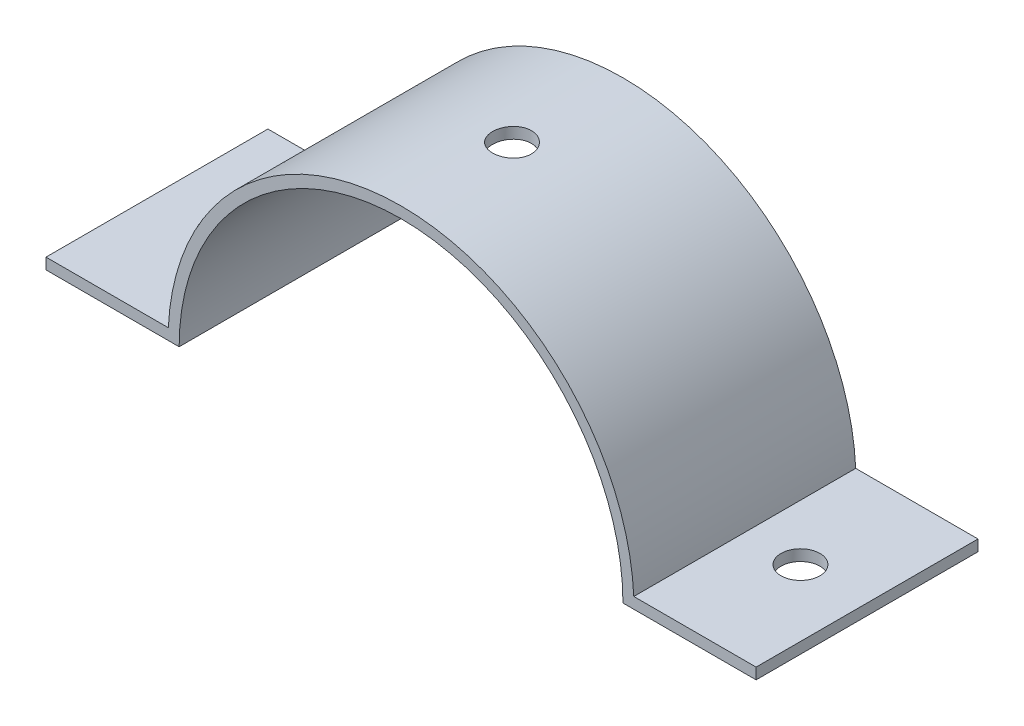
from build123d import *

# Parameters (mm, degrees)
EXTRUDE1_DEPTH = 20
SKETCH2_R      = 1.75
EXTRUDE2_DEPTH = 20
SKETCH3_R      = 1.75
EXTRUDE3_DEPTH = 44.185645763


with BuildPart() as part:
    # Sketch1 → Extrude1 (new body)
    with BuildSketch(Plane.XY):
        with BuildLine():
            Line((20, 0), (32, 0))
            Line((32, 0), (32, 1))
            Line((32, 1), (20.976176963, 1))
            ThreePointArc((20.976176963, 1), (0, 21), (-20.976176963, 1))
            Line((-20.976176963, 1), (-32, 1))
            Line((-32, 1), (-32, 0))
            Line((-32, 0), (-20, 0))
            ThreePointArc((-20, 0), (0, 20), (20, 0))
        make_face()
    extrude(amount=EXTRUDE1_DEPTH)

    # Sketch2 → Extrude2 (cut)
    with BuildSketch(Plane(origin=(0, 1, 0), x_dir=(1, 0, 0), z_dir=(0, 1, 0))):
        with Locations(Location((26, -10, 0), (0, 0, 270))):
            Circle(SKETCH2_R)
        with Locations(Location((-26, -10, 0), (0, 0, 270))):
            Circle(SKETCH2_R)
    extrude(amount=-EXTRUDE2_DEPTH, mode=Mode.SUBTRACT)

    # Sketch3 → Extrude3 (cut, through all)
    with BuildSketch(Plane(origin=(0, 0, 0), x_dir=(1, 0, 0), z_dir=(0, 1, 0))):
        with Locations(Location((0, -10, 0), (0, 0, 90))):
            Circle(SKETCH3_R)
    extrude(amount=EXTRUDE3_DEPTH, mode=Mode.SUBTRACT)


solid = part.part
